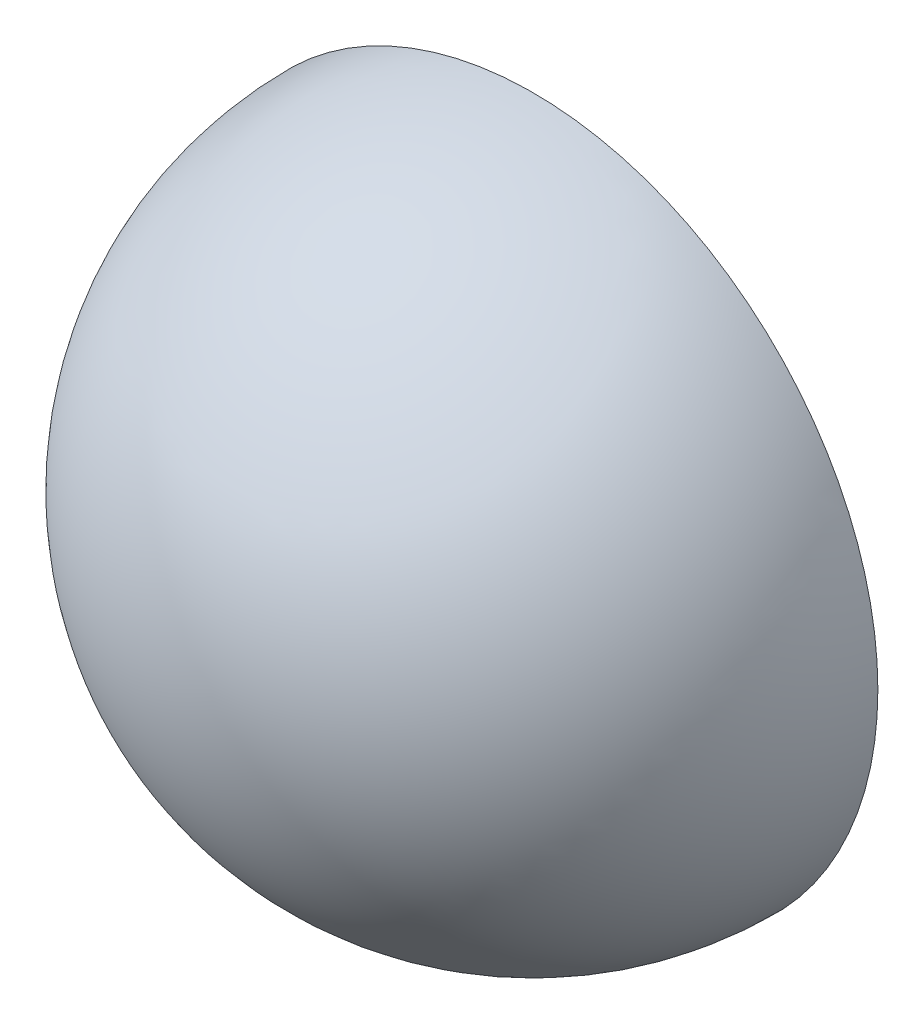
ISO-10303-21;
HEADER;
FILE_DESCRIPTION(('STEP AP214'),'2;1');
FILE_NAME('part.step','',(''),(''),'','','');
FILE_SCHEMA(('AUTOMOTIVE_DESIGN { 1 0 10303 214 1 1 1 1 }'));
ENDSEC;
DATA;
#1=APPLICATION_CONTEXT('core data for automotive mechanical design processes');
#2=APPLICATION_PROTOCOL_DEFINITION('international standard','automotive_design',2000,#1);
#3=PRODUCT_CONTEXT('',#1,'mechanical');
#4=PRODUCT('Part','Part','',(#3));
#5=PRODUCT_RELATED_PRODUCT_CATEGORY('part','',(#4));
#6=PRODUCT_DEFINITION_FORMATION('','',#4);
#7=PRODUCT_DEFINITION_CONTEXT('part definition',#1,'design');
#8=PRODUCT_DEFINITION('design','',#6,#7);
#9=PRODUCT_DEFINITION_SHAPE('','',#8);
#10=(LENGTH_UNIT() NAMED_UNIT(*) SI_UNIT(.MILLI.,.METRE.));
#11=(NAMED_UNIT(*) PLANE_ANGLE_UNIT() SI_UNIT($,.RADIAN.));
#12=(NAMED_UNIT(*) SI_UNIT($,.STERADIAN.) SOLID_ANGLE_UNIT());
#13=UNCERTAINTY_MEASURE_WITH_UNIT(LENGTH_MEASURE(1.E-05),#10,'distance_accuracy_value','');
#14=(GEOMETRIC_REPRESENTATION_CONTEXT(3) GLOBAL_UNCERTAINTY_ASSIGNED_CONTEXT((#13)) GLOBAL_UNIT_ASSIGNED_CONTEXT((#10,
#11,#12)) REPRESENTATION_CONTEXT('',''));
#15=CARTESIAN_POINT('',(0.,0.,0.));
#16=DIRECTION('',(0.,0.,1.));
#17=DIRECTION('',(1.,0.,0.));
#18=AXIS2_PLACEMENT_3D('',#15,#16,#17);
#19=CARTESIAN_POINT('',(0.,0.,0.));
#20=DIRECTION('',(-1.,0.,0.));
#21=DIRECTION('',(0.,-1.,0.));
#22=AXIS2_PLACEMENT_3D('',#19,#20,#21);
#23=SPHERICAL_SURFACE('',#22,1.25);
#24=CARTESIAN_POINT('',(0.,0.,0.));
#25=DIRECTION('',(0.,0.,-1.));
#26=DIRECTION('',(1.,0.,0.));
#27=AXIS2_PLACEMENT_3D('',#24,#25,#26);
#28=SPHERICAL_SURFACE('',#27,1.25);
#29=CARTESIAN_POINT('',(0.,0.,0.));
#30=DIRECTION('',(0.,0.,-1.));
#31=DIRECTION('',(1.,0.,0.));
#32=AXIS2_PLACEMENT_3D('',#29,#30,#31);
#33=CIRCLE('',#32,1.25);
#34=CARTESIAN_POINT('',(1.25,0.,0.));
#35=VERTEX_POINT('',#34);
#36=EDGE_CURVE('E10',#35,#35,#33,.T.);
#37=ORIENTED_EDGE('',*,*,#36,.F.);
#38=EDGE_LOOP('',(#37));
#39=FACE_BOUND('',#38,.T.);
#40=ADVANCED_FACE('F33',(#39),#28,.T.);
#41=CARTESIAN_POINT('',(0.,0.,0.));
#42=DIRECTION('',(0.,0.,-1.));
#43=DIRECTION('',(1.,0.,0.));
#44=AXIS2_PLACEMENT_3D('',#41,#42,#43);
#45=PLANE('',#44);
#46=CARTESIAN_POINT('',(0.,0.,0.));
#47=DIRECTION('',(0.,0.,-1.));
#48=DIRECTION('',(0.,1.,0.));
#49=AXIS2_PLACEMENT_3D('',#46,#47,#48);
#50=CIRCLE('',#49,1.);
#51=CARTESIAN_POINT('',(0.,1.,0.));
#52=VERTEX_POINT('',#51);
#53=EDGE_CURVE('E43',#52,#52,#50,.T.);
#54=ORIENTED_EDGE('',*,*,#53,.F.);
#55=EDGE_LOOP('',(#54));
#56=FACE_BOUND('',#55,.T.);
#57=ORIENTED_EDGE('',*,*,#36,.T.);
#58=EDGE_LOOP('',(#57));
#59=FACE_BOUND('',#58,.T.);
#60=ADVANCED_FACE('F52',(#56,#59),#45,.T.);
#61=CARTESIAN_POINT('',(0.,0.,0.5));
#62=DIRECTION('',(0.,0.,-1.));
#63=DIRECTION('',(0.,1.,0.));
#64=AXIS2_PLACEMENT_3D('',#61,#62,#63);
#65=CYLINDRICAL_SURFACE('',#64,1.);
#66=CARTESIAN_POINT('',(0.,0.,0.5));
#67=DIRECTION('',(0.,0.,-1.));
#68=DIRECTION('',(0.,1.,0.));
#69=AXIS2_PLACEMENT_3D('',#66,#67,#68);
#70=CIRCLE('',#69,1.);
#71=CARTESIAN_POINT('',(0.,0.999999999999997,0.500000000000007));
#72=VERTEX_POINT('',#71);
#73=EDGE_CURVE('E39',#72,#72,#70,.T.);
#74=ORIENTED_EDGE('',*,*,#73,.F.);
#75=EDGE_LOOP('',(#74));
#76=FACE_BOUND('',#75,.T.);
#77=ORIENTED_EDGE('',*,*,#53,.T.);
#78=EDGE_LOOP('',(#77));
#79=FACE_BOUND('',#78,.T.);
#80=ADVANCED_FACE('F50',(#76,#79),#65,.F.);
#81=CARTESIAN_POINT('',(0.,0.,0.5));
#82=DIRECTION('',(0.,0.,-1.));
#83=DIRECTION('',(0.,1.,0.));
#84=AXIS2_PLACEMENT_3D('',#81,#82,#83);
#85=PLANE('',#84);
#86=ORIENTED_EDGE('',*,*,#73,.T.);
#87=EDGE_LOOP('',(#86));
#88=FACE_BOUND('',#87,.T.);
#89=ADVANCED_FACE('F58',(#88),#85,.T.);
#90=CLOSED_SHELL('',(#40,#60,#80,#89));
#91=MANIFOLD_SOLID_BREP('B2',#90);
#92=ADVANCED_BREP_SHAPE_REPRESENTATION('',(#18,#91),#14);
#93=SHAPE_DEFINITION_REPRESENTATION(#9,#92);
ENDSEC;
END-ISO-10303-21;
